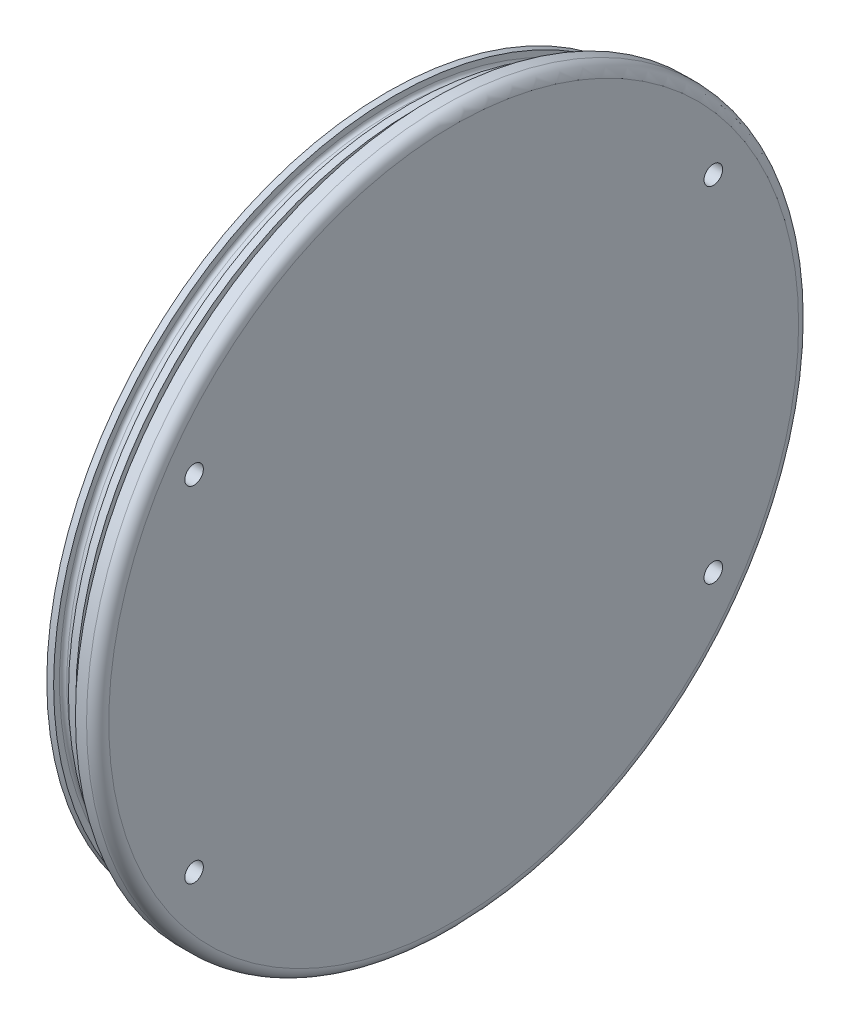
ISO-10303-21;
HEADER;
FILE_DESCRIPTION(('STEP AP214'),'2;1');
FILE_NAME('part.step','',(''),(''),'','','');
FILE_SCHEMA(('AUTOMOTIVE_DESIGN { 1 0 10303 214 1 1 1 1 }'));
ENDSEC;
DATA;
#1=APPLICATION_CONTEXT('core data for automotive mechanical design processes');
#2=APPLICATION_PROTOCOL_DEFINITION('international standard','automotive_design',2000,#1);
#3=PRODUCT_CONTEXT('',#1,'mechanical');
#4=PRODUCT('Part','Part','',(#3));
#5=PRODUCT_RELATED_PRODUCT_CATEGORY('part','',(#4));
#6=PRODUCT_DEFINITION_FORMATION('','',#4);
#7=PRODUCT_DEFINITION_CONTEXT('part definition',#1,'design');
#8=PRODUCT_DEFINITION('design','',#6,#7);
#9=PRODUCT_DEFINITION_SHAPE('','',#8);
#10=(LENGTH_UNIT() NAMED_UNIT(*) SI_UNIT(.MILLI.,.METRE.));
#11=(NAMED_UNIT(*) PLANE_ANGLE_UNIT() SI_UNIT($,.RADIAN.));
#12=(NAMED_UNIT(*) SI_UNIT($,.STERADIAN.) SOLID_ANGLE_UNIT());
#13=UNCERTAINTY_MEASURE_WITH_UNIT(LENGTH_MEASURE(1.E-05),#10,'distance_accuracy_value','');
#14=(GEOMETRIC_REPRESENTATION_CONTEXT(3) GLOBAL_UNCERTAINTY_ASSIGNED_CONTEXT((#13)) GLOBAL_UNIT_ASSIGNED_CONTEXT((#10,
#11,#12)) REPRESENTATION_CONTEXT('',''));
#15=CARTESIAN_POINT('',(0.,0.,0.));
#16=DIRECTION('',(0.,0.,1.));
#17=DIRECTION('',(1.,0.,0.));
#18=AXIS2_PLACEMENT_3D('',#15,#16,#17);
#19=CARTESIAN_POINT('',(9.525,0.,0.));
#20=DIRECTION('',(1.,0.,0.));
#21=DIRECTION('',(0.,0.,-1.));
#22=AXIS2_PLACEMENT_3D('',#19,#20,#21);
#23=PLANE('',#22);
#24=CARTESIAN_POINT('',(9.525,0.,0.));
#25=DIRECTION('',(1.,0.,0.));
#26=DIRECTION('',(0.,0.,-1.));
#27=AXIS2_PLACEMENT_3D('',#24,#25,#26);
#28=CIRCLE('',#27,147.6375);
#29=CARTESIAN_POINT('',(9.525,0.,-147.6375));
#30=VERTEX_POINT('',#29);
#31=EDGE_CURVE('E74',#30,#30,#28,.T.);
#32=ORIENTED_EDGE('',*,*,#31,.T.);
#33=EDGE_LOOP('',(#32));
#34=FACE_BOUND('',#33,.T.);
#35=CARTESIAN_POINT('',(9.525,-73.7119859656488,-111.125));
#36=DIRECTION('',(1.,0.,0.));
#37=DIRECTION('',(0.,0.,-1.));
#38=AXIS2_PLACEMENT_3D('',#35,#36,#37);
#39=CIRCLE('',#38,3.96874999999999);
#40=CARTESIAN_POINT('',(9.525,-73.7119859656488,-115.09375));
#41=VERTEX_POINT('',#40);
#42=EDGE_CURVE('E119',#41,#41,#39,.T.);
#43=ORIENTED_EDGE('',*,*,#42,.F.);
#44=EDGE_LOOP('',(#43));
#45=FACE_BOUND('',#44,.T.);
#46=CARTESIAN_POINT('',(9.525,-73.7119859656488,111.125));
#47=DIRECTION('',(1.,0.,0.));
#48=DIRECTION('',(0.,0.,-1.));
#49=AXIS2_PLACEMENT_3D('',#46,#47,#48);
#50=CIRCLE('',#49,3.96874999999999);
#51=CARTESIAN_POINT('',(9.525,-73.7119859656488,107.15625));
#52=VERTEX_POINT('',#51);
#53=EDGE_CURVE('E113',#52,#52,#50,.T.);
#54=ORIENTED_EDGE('',*,*,#53,.F.);
#55=EDGE_LOOP('',(#54));
#56=FACE_BOUND('',#55,.T.);
#57=CARTESIAN_POINT('',(9.525,73.7119859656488,111.125));
#58=DIRECTION('',(1.,0.,0.));
#59=DIRECTION('',(0.,0.,-1.));
#60=AXIS2_PLACEMENT_3D('',#57,#58,#59);
#61=CIRCLE('',#60,3.96874999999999);
#62=CARTESIAN_POINT('',(9.525,73.7119859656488,107.15625));
#63=VERTEX_POINT('',#62);
#64=EDGE_CURVE('E107',#63,#63,#61,.T.);
#65=ORIENTED_EDGE('',*,*,#64,.F.);
#66=EDGE_LOOP('',(#65));
#67=FACE_BOUND('',#66,.T.);
#68=CARTESIAN_POINT('',(9.525,73.7119859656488,-111.125));
#69=DIRECTION('',(1.,0.,0.));
#70=DIRECTION('',(0.,0.,-1.));
#71=AXIS2_PLACEMENT_3D('',#68,#69,#70);
#72=CIRCLE('',#71,3.96874999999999);
#73=CARTESIAN_POINT('',(9.525,73.7119859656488,-115.09375));
#74=VERTEX_POINT('',#73);
#75=EDGE_CURVE('E101',#74,#74,#72,.T.);
#76=ORIENTED_EDGE('',*,*,#75,.F.);
#77=EDGE_LOOP('',(#76));
#78=FACE_BOUND('',#77,.T.);
#79=ADVANCED_FACE('F39',(#34,#45,#56,#67,#78),#23,.T.);
#80=CARTESIAN_POINT('',(0.,0.,0.));
#81=DIRECTION('',(1.,0.,0.));
#82=DIRECTION('',(0.,0.,-1.));
#83=AXIS2_PLACEMENT_3D('',#80,#81,#82);
#84=CYLINDRICAL_SURFACE('',#83,152.4);
#85=CARTESIAN_POINT('',(4.7625,0.,0.));
#86=DIRECTION('',(1.,0.,0.));
#87=DIRECTION('',(0.,0.,-1.));
#88=AXIS2_PLACEMENT_3D('',#85,#86,#87);
#89=CIRCLE('',#88,152.4);
#90=CARTESIAN_POINT('',(4.7625,0.,-152.4));
#91=VERTEX_POINT('',#90);
#92=EDGE_CURVE('E71',#91,#91,#89,.F.);
#93=ORIENTED_EDGE('',*,*,#92,.T.);
#94=EDGE_LOOP('',(#93));
#95=FACE_BOUND('',#94,.T.);
#96=CARTESIAN_POINT('',(0.,0.,0.));
#97=DIRECTION('',(1.,0.,0.));
#98=DIRECTION('',(0.,0.,-1.));
#99=AXIS2_PLACEMENT_3D('',#96,#97,#98);
#100=CIRCLE('',#99,152.4);
#101=CARTESIAN_POINT('',(0.,0.,-152.4));
#102=VERTEX_POINT('',#101);
#103=EDGE_CURVE('E77',#102,#102,#100,.T.);
#104=ORIENTED_EDGE('',*,*,#103,.T.);
#105=EDGE_LOOP('',(#104));
#106=FACE_BOUND('',#105,.T.);
#107=ADVANCED_FACE('F127',(#95,#106),#84,.T.);
#108=CARTESIAN_POINT('',(0.,145.6055,0.));
#109=DIRECTION('',(-1.,0.,0.));
#110=DIRECTION('',(0.,0.,1.));
#111=AXIS2_PLACEMENT_3D('',#108,#109,#110);
#112=PLANE('',#111);
#113=CARTESIAN_POINT('',(0.,0.,0.));
#114=DIRECTION('',(1.,0.,0.));
#115=DIRECTION('',(0.,0.,-1.));
#116=AXIS2_PLACEMENT_3D('',#113,#114,#115);
#117=CIRCLE('',#116,145.6055);
#118=CARTESIAN_POINT('',(0.,0.,-145.6055));
#119=VERTEX_POINT('',#118);
#120=EDGE_CURVE('E80',#119,#119,#117,.T.);
#121=ORIENTED_EDGE('',*,*,#120,.T.);
#122=EDGE_LOOP('',(#121));
#123=FACE_BOUND('',#122,.T.);
#124=ORIENTED_EDGE('',*,*,#103,.F.);
#125=EDGE_LOOP('',(#124));
#126=FACE_BOUND('',#125,.T.);
#127=ADVANCED_FACE('F191',(#123,#126),#112,.T.);
#128=CARTESIAN_POINT('',(0.,0.,0.));
#129=DIRECTION('',(1.,0.,0.));
#130=DIRECTION('',(0.,0.,-1.));
#131=AXIS2_PLACEMENT_3D('',#128,#129,#130);
#132=CYLINDRICAL_SURFACE('',#131,145.6055);
#133=CARTESIAN_POINT('',(-0.254,0.,0.));
#134=DIRECTION('',(1.,0.,0.));
#135=DIRECTION('',(0.,0.,-1.));
#136=AXIS2_PLACEMENT_3D('',#133,#134,#135);
#137=CIRCLE('',#136,145.6055);
#138=CARTESIAN_POINT('',(-0.254,0.,-145.6055));
#139=VERTEX_POINT('',#138);
#140=EDGE_CURVE('E83',#139,#139,#137,.T.);
#141=ORIENTED_EDGE('',*,*,#140,.T.);
#142=EDGE_LOOP('',(#141));
#143=FACE_BOUND('',#142,.T.);
#144=ORIENTED_EDGE('',*,*,#120,.F.);
#145=EDGE_LOOP('',(#144));
#146=FACE_BOUND('',#145,.T.);
#147=ADVANCED_FACE('F188',(#143,#146),#132,.T.);
#148=CARTESIAN_POINT('',(-0.254,145.6055,0.));
#149=DIRECTION('',(-1.,0.,0.));
#150=DIRECTION('',(0.,0.,1.));
#151=AXIS2_PLACEMENT_3D('',#148,#149,#150);
#152=PLANE('',#151);
#153=CARTESIAN_POINT('',(-0.254,0.,0.));
#154=DIRECTION('',(-1.,0.,0.));
#155=DIRECTION('',(0.,0.,1.));
#156=AXIS2_PLACEMENT_3D('',#153,#154,#155);
#157=CIRCLE('',#156,143.0782);
#158=CARTESIAN_POINT('',(-0.254,0.,143.0782));
#159=VERTEX_POINT('',#158);
#160=EDGE_CURVE('E10',#159,#159,#157,.F.);
#161=ORIENTED_EDGE('',*,*,#160,.T.);
#162=EDGE_LOOP('',(#161));
#163=FACE_BOUND('',#162,.T.);
#164=ORIENTED_EDGE('',*,*,#140,.F.);
#165=EDGE_LOOP('',(#164));
#166=FACE_BOUND('',#165,.T.);
#167=ADVANCED_FACE('F184',(#163,#166),#152,.T.);
#168=CARTESIAN_POINT('',(0.,0.,0.));
#169=DIRECTION('',(1.,0.,0.));
#170=DIRECTION('',(0.,0.,-1.));
#171=AXIS2_PLACEMENT_3D('',#168,#169,#170);
#172=CYLINDRICAL_SURFACE('',#171,141.4907);
#173=CARTESIAN_POINT('',(-5.0165,0.,0.));
#174=DIRECTION('',(1.,0.,0.));
#175=DIRECTION('',(0.,0.,-1.));
#176=AXIS2_PLACEMENT_3D('',#173,#174,#175);
#177=CIRCLE('',#176,141.4907);
#178=CARTESIAN_POINT('',(-5.0165,0.,-141.4907));
#179=VERTEX_POINT('',#178);
#180=EDGE_CURVE('E50',#179,#179,#177,.T.);
#181=ORIENTED_EDGE('',*,*,#180,.T.);
#182=EDGE_LOOP('',(#181));
#183=FACE_BOUND('',#182,.T.);
#184=CARTESIAN_POINT('',(-1.8415,0.,0.));
#185=DIRECTION('',(-1.,0.,0.));
#186=DIRECTION('',(0.,0.,1.));
#187=AXIS2_PLACEMENT_3D('',#184,#185,#186);
#188=CIRCLE('',#187,141.4907);
#189=CARTESIAN_POINT('',(-1.8415,0.,141.4907));
#190=VERTEX_POINT('',#189);
#191=EDGE_CURVE('E54',#190,#190,#188,.T.);
#192=ORIENTED_EDGE('',*,*,#191,.T.);
#193=EDGE_LOOP('',(#192));
#194=FACE_BOUND('',#193,.T.);
#195=ADVANCED_FACE('F181',(#183,#194),#172,.T.);
#196=CARTESIAN_POINT('',(-6.604,141.4907,0.));
#197=DIRECTION('',(1.,0.,0.));
#198=DIRECTION('',(0.,0.,-1.));
#199=AXIS2_PLACEMENT_3D('',#196,#197,#198);
#200=PLANE('',#199);
#201=CARTESIAN_POINT('',(-6.604,0.,0.));
#202=DIRECTION('',(1.,0.,0.));
#203=DIRECTION('',(0.,0.,-1.));
#204=AXIS2_PLACEMENT_3D('',#201,#202,#203);
#205=CIRCLE('',#204,143.0782);
#206=CARTESIAN_POINT('',(-6.604,0.,-143.0782));
#207=VERTEX_POINT('',#206);
#208=EDGE_CURVE('E46',#207,#207,#205,.F.);
#209=ORIENTED_EDGE('',*,*,#208,.T.);
#210=EDGE_LOOP('',(#209));
#211=FACE_BOUND('',#210,.T.);
#212=CARTESIAN_POINT('',(-6.604,0.,0.));
#213=DIRECTION('',(1.,0.,0.));
#214=DIRECTION('',(0.,0.,-1.));
#215=AXIS2_PLACEMENT_3D('',#212,#213,#214);
#216=CIRCLE('',#215,145.6055);
#217=CARTESIAN_POINT('',(-6.604,0.,-145.6055));
#218=VERTEX_POINT('',#217);
#219=EDGE_CURVE('E86',#218,#218,#216,.T.);
#220=ORIENTED_EDGE('',*,*,#219,.T.);
#221=EDGE_LOOP('',(#220));
#222=FACE_BOUND('',#221,.T.);
#223=ADVANCED_FACE('F177',(#211,#222),#200,.T.);
#224=CARTESIAN_POINT('',(0.,0.,0.));
#225=DIRECTION('',(1.,0.,0.));
#226=DIRECTION('',(0.,0.,-1.));
#227=AXIS2_PLACEMENT_3D('',#224,#225,#226);
#228=CYLINDRICAL_SURFACE('',#227,145.6055);
#229=CARTESIAN_POINT('',(-9.779,0.,0.));
#230=DIRECTION('',(1.,0.,0.));
#231=DIRECTION('',(0.,0.,-1.));
#232=AXIS2_PLACEMENT_3D('',#229,#230,#231);
#233=CIRCLE('',#232,145.6055);
#234=CARTESIAN_POINT('',(-9.779,0.,-145.6055));
#235=VERTEX_POINT('',#234);
#236=EDGE_CURVE('E89',#235,#235,#233,.T.);
#237=ORIENTED_EDGE('',*,*,#236,.T.);
#238=EDGE_LOOP('',(#237));
#239=FACE_BOUND('',#238,.T.);
#240=ORIENTED_EDGE('',*,*,#219,.F.);
#241=EDGE_LOOP('',(#240));
#242=FACE_BOUND('',#241,.T.);
#243=ADVANCED_FACE('F173',(#239,#242),#228,.T.);
#244=CARTESIAN_POINT('',(-9.779,145.6055,0.));
#245=DIRECTION('',(-1.,0.,0.));
#246=DIRECTION('',(0.,0.,1.));
#247=AXIS2_PLACEMENT_3D('',#244,#245,#246);
#248=PLANE('',#247);
#249=CARTESIAN_POINT('',(-9.779,0.,0.));
#250=DIRECTION('',(-1.,0.,0.));
#251=DIRECTION('',(0.,0.,1.));
#252=AXIS2_PLACEMENT_3D('',#249,#250,#251);
#253=CIRCLE('',#252,143.0782);
#254=CARTESIAN_POINT('',(-9.779,0.,143.0782));
#255=VERTEX_POINT('',#254);
#256=EDGE_CURVE('E59',#255,#255,#253,.F.);
#257=ORIENTED_EDGE('',*,*,#256,.T.);
#258=EDGE_LOOP('',(#257));
#259=FACE_BOUND('',#258,.T.);
#260=ORIENTED_EDGE('',*,*,#236,.F.);
#261=EDGE_LOOP('',(#260));
#262=FACE_BOUND('',#261,.T.);
#263=ADVANCED_FACE('F169',(#259,#262),#248,.T.);
#264=CARTESIAN_POINT('',(0.,0.,0.));
#265=DIRECTION('',(1.,0.,0.));
#266=DIRECTION('',(0.,0.,-1.));
#267=AXIS2_PLACEMENT_3D('',#264,#265,#266);
#268=CYLINDRICAL_SURFACE('',#267,141.4907);
#269=CARTESIAN_POINT('',(-14.5415,0.,0.));
#270=DIRECTION('',(1.,0.,0.));
#271=DIRECTION('',(0.,0.,-1.));
#272=AXIS2_PLACEMENT_3D('',#269,#270,#271);
#273=CIRCLE('',#272,141.4907);
#274=CARTESIAN_POINT('',(-14.5415,0.,-141.4907));
#275=VERTEX_POINT('',#274);
#276=EDGE_CURVE('E65',#275,#275,#273,.T.);
#277=ORIENTED_EDGE('',*,*,#276,.T.);
#278=EDGE_LOOP('',(#277));
#279=FACE_BOUND('',#278,.T.);
#280=CARTESIAN_POINT('',(-11.3665,0.,0.));
#281=DIRECTION('',(-1.,0.,0.));
#282=DIRECTION('',(0.,0.,1.));
#283=AXIS2_PLACEMENT_3D('',#280,#281,#282);
#284=CIRCLE('',#283,141.4907);
#285=CARTESIAN_POINT('',(-11.3665,0.,141.4907));
#286=VERTEX_POINT('',#285);
#287=EDGE_CURVE('E68',#286,#286,#284,.T.);
#288=ORIENTED_EDGE('',*,*,#287,.T.);
#289=EDGE_LOOP('',(#288));
#290=FACE_BOUND('',#289,.T.);
#291=ADVANCED_FACE('F165',(#279,#290),#268,.T.);
#292=CARTESIAN_POINT('',(-16.129,141.4907,0.));
#293=DIRECTION('',(1.,0.,0.));
#294=DIRECTION('',(0.,0.,-1.));
#295=AXIS2_PLACEMENT_3D('',#292,#293,#294);
#296=PLANE('',#295);
#297=CARTESIAN_POINT('',(-16.129,0.,0.));
#298=DIRECTION('',(1.,0.,0.));
#299=DIRECTION('',(0.,0.,-1.));
#300=AXIS2_PLACEMENT_3D('',#297,#298,#299);
#301=CIRCLE('',#300,143.0782);
#302=CARTESIAN_POINT('',(-16.129,0.,-143.0782));
#303=VERTEX_POINT('',#302);
#304=EDGE_CURVE('E62',#303,#303,#301,.F.);
#305=ORIENTED_EDGE('',*,*,#304,.T.);
#306=EDGE_LOOP('',(#305));
#307=FACE_BOUND('',#306,.T.);
#308=CARTESIAN_POINT('',(-16.129,0.,0.));
#309=DIRECTION('',(1.,0.,0.));
#310=DIRECTION('',(0.,0.,-1.));
#311=AXIS2_PLACEMENT_3D('',#308,#309,#310);
#312=CIRCLE('',#311,145.6055);
#313=CARTESIAN_POINT('',(-16.129,0.,-145.6055));
#314=VERTEX_POINT('',#313);
#315=EDGE_CURVE('E92',#314,#314,#312,.T.);
#316=ORIENTED_EDGE('',*,*,#315,.T.);
#317=EDGE_LOOP('',(#316));
#318=FACE_BOUND('',#317,.T.);
#319=ADVANCED_FACE('F161',(#307,#318),#296,.T.);
#320=CARTESIAN_POINT('',(0.,0.,0.));
#321=DIRECTION('',(1.,0.,0.));
#322=DIRECTION('',(0.,0.,-1.));
#323=AXIS2_PLACEMENT_3D('',#320,#321,#322);
#324=CYLINDRICAL_SURFACE('',#323,145.6055);
#325=CARTESIAN_POINT('',(-19.05,0.,0.));
#326=DIRECTION('',(1.,0.,0.));
#327=DIRECTION('',(0.,0.,-1.));
#328=AXIS2_PLACEMENT_3D('',#325,#326,#327);
#329=CIRCLE('',#328,145.6055);
#330=CARTESIAN_POINT('',(-19.05,0.,-145.6055));
#331=VERTEX_POINT('',#330);
#332=EDGE_CURVE('E95',#331,#331,#329,.T.);
#333=ORIENTED_EDGE('',*,*,#332,.T.);
#334=EDGE_LOOP('',(#333));
#335=FACE_BOUND('',#334,.T.);
#336=ORIENTED_EDGE('',*,*,#315,.F.);
#337=EDGE_LOOP('',(#336));
#338=FACE_BOUND('',#337,.T.);
#339=ADVANCED_FACE('F157',(#335,#338),#324,.T.);
#340=CARTESIAN_POINT('',(-19.05,145.6055,0.));
#341=DIRECTION('',(-1.,0.,0.));
#342=DIRECTION('',(0.,0.,1.));
#343=AXIS2_PLACEMENT_3D('',#340,#341,#342);
#344=PLANE('',#343);
#345=ORIENTED_EDGE('',*,*,#332,.F.);
#346=EDGE_LOOP('',(#345));
#347=FACE_BOUND('',#346,.T.);
#348=ADVANCED_FACE('F149',(#347),#344,.T.);
#349=CARTESIAN_POINT('',(-3.175,73.7119859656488,-111.125));
#350=DIRECTION('',(-1.,0.,0.));
#351=DIRECTION('',(0.,0.,1.));
#352=AXIS2_PLACEMENT_3D('',#349,#350,#351);
#353=PLANE('',#352);
#354=CARTESIAN_POINT('',(-3.175,73.7119859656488,-111.125));
#355=DIRECTION('',(1.,0.,0.));
#356=DIRECTION('',(0.,0.,-1.));
#357=AXIS2_PLACEMENT_3D('',#354,#355,#356);
#358=CIRCLE('',#357,3.96874999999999);
#359=CARTESIAN_POINT('',(-3.175,73.7119859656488,-115.09375));
#360=VERTEX_POINT('',#359);
#361=EDGE_CURVE('E98',#360,#360,#358,.T.);
#362=ORIENTED_EDGE('',*,*,#361,.T.);
#363=EDGE_LOOP('',(#362));
#364=FACE_BOUND('',#363,.T.);
#365=ADVANCED_FACE('F139',(#364),#353,.F.);
#366=CARTESIAN_POINT('',(9.525,73.7119859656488,-111.125));
#367=DIRECTION('',(1.,0.,0.));
#368=DIRECTION('',(0.,0.,-1.));
#369=AXIS2_PLACEMENT_3D('',#366,#367,#368);
#370=CYLINDRICAL_SURFACE('',#369,3.96874999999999);
#371=ORIENTED_EDGE('',*,*,#361,.F.);
#372=EDGE_LOOP('',(#371));
#373=FACE_BOUND('',#372,.T.);
#374=ORIENTED_EDGE('',*,*,#75,.T.);
#375=EDGE_LOOP('',(#374));
#376=FACE_BOUND('',#375,.T.);
#377=ADVANCED_FACE('F136',(#373,#376),#370,.F.);
#378=CARTESIAN_POINT('',(-3.175,73.7119859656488,111.125));
#379=DIRECTION('',(-1.,0.,0.));
#380=DIRECTION('',(0.,0.,1.));
#381=AXIS2_PLACEMENT_3D('',#378,#379,#380);
#382=PLANE('',#381);
#383=CARTESIAN_POINT('',(-3.175,73.7119859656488,111.125));
#384=DIRECTION('',(1.,0.,0.));
#385=DIRECTION('',(0.,0.,-1.));
#386=AXIS2_PLACEMENT_3D('',#383,#384,#385);
#387=CIRCLE('',#386,3.96874999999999);
#388=CARTESIAN_POINT('',(-3.175,73.7119859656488,107.15625));
#389=VERTEX_POINT('',#388);
#390=EDGE_CURVE('E104',#389,#389,#387,.T.);
#391=ORIENTED_EDGE('',*,*,#390,.T.);
#392=EDGE_LOOP('',(#391));
#393=FACE_BOUND('',#392,.T.);
#394=ADVANCED_FACE('F138',(#393),#382,.F.);
#395=CARTESIAN_POINT('',(9.525,73.7119859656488,111.125));
#396=DIRECTION('',(1.,0.,0.));
#397=DIRECTION('',(0.,0.,-1.));
#398=AXIS2_PLACEMENT_3D('',#395,#396,#397);
#399=CYLINDRICAL_SURFACE('',#398,3.96874999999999);
#400=ORIENTED_EDGE('',*,*,#390,.F.);
#401=EDGE_LOOP('',(#400));
#402=FACE_BOUND('',#401,.T.);
#403=ORIENTED_EDGE('',*,*,#64,.T.);
#404=EDGE_LOOP('',(#403));
#405=FACE_BOUND('',#404,.T.);
#406=ADVANCED_FACE('F146',(#402,#405),#399,.F.);
#407=CARTESIAN_POINT('',(-3.175,-73.7119859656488,111.125));
#408=DIRECTION('',(-1.,0.,0.));
#409=DIRECTION('',(0.,0.,1.));
#410=AXIS2_PLACEMENT_3D('',#407,#408,#409);
#411=PLANE('',#410);
#412=CARTESIAN_POINT('',(-3.175,-73.7119859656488,111.125));
#413=DIRECTION('',(1.,0.,0.));
#414=DIRECTION('',(0.,0.,-1.));
#415=AXIS2_PLACEMENT_3D('',#412,#413,#414);
#416=CIRCLE('',#415,3.96874999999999);
#417=CARTESIAN_POINT('',(-3.175,-73.7119859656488,107.15625));
#418=VERTEX_POINT('',#417);
#419=EDGE_CURVE('E110',#418,#418,#416,.T.);
#420=ORIENTED_EDGE('',*,*,#419,.T.);
#421=EDGE_LOOP('',(#420));
#422=FACE_BOUND('',#421,.T.);
#423=ADVANCED_FACE('F329',(#422),#411,.F.);
#424=CARTESIAN_POINT('',(9.525,-73.7119859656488,111.125));
#425=DIRECTION('',(1.,0.,0.));
#426=DIRECTION('',(0.,0.,-1.));
#427=AXIS2_PLACEMENT_3D('',#424,#425,#426);
#428=CYLINDRICAL_SURFACE('',#427,3.96874999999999);
#429=ORIENTED_EDGE('',*,*,#419,.F.);
#430=EDGE_LOOP('',(#429));
#431=FACE_BOUND('',#430,.T.);
#432=ORIENTED_EDGE('',*,*,#53,.T.);
#433=EDGE_LOOP('',(#432));
#434=FACE_BOUND('',#433,.T.);
#435=ADVANCED_FACE('F318',(#431,#434),#428,.F.);
#436=CARTESIAN_POINT('',(-3.175,-73.7119859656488,-111.125));
#437=DIRECTION('',(-1.,0.,0.));
#438=DIRECTION('',(0.,0.,1.));
#439=AXIS2_PLACEMENT_3D('',#436,#437,#438);
#440=PLANE('',#439);
#441=CARTESIAN_POINT('',(-3.175,-73.7119859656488,-111.125));
#442=DIRECTION('',(1.,0.,0.));
#443=DIRECTION('',(0.,0.,-1.));
#444=AXIS2_PLACEMENT_3D('',#441,#442,#443);
#445=CIRCLE('',#444,3.96874999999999);
#446=CARTESIAN_POINT('',(-3.175,-73.7119859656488,-115.09375));
#447=VERTEX_POINT('',#446);
#448=EDGE_CURVE('E116',#447,#447,#445,.T.);
#449=ORIENTED_EDGE('',*,*,#448,.T.);
#450=EDGE_LOOP('',(#449));
#451=FACE_BOUND('',#450,.T.);
#452=ADVANCED_FACE('F308',(#451),#440,.F.);
#453=CARTESIAN_POINT('',(9.525,-73.7119859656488,-111.125));
#454=DIRECTION('',(1.,0.,0.));
#455=DIRECTION('',(0.,0.,-1.));
#456=AXIS2_PLACEMENT_3D('',#453,#454,#455);
#457=CYLINDRICAL_SURFACE('',#456,3.96874999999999);
#458=ORIENTED_EDGE('',*,*,#448,.F.);
#459=EDGE_LOOP('',(#458));
#460=FACE_BOUND('',#459,.T.);
#461=ORIENTED_EDGE('',*,*,#42,.T.);
#462=EDGE_LOOP('',(#461));
#463=FACE_BOUND('',#462,.T.);
#464=ADVANCED_FACE('F123',(#460,#463),#457,.F.);
#465=CARTESIAN_POINT('',(4.7625,0.,0.));
#466=DIRECTION('',(1.,0.,0.));
#467=DIRECTION('',(0.,0.,-1.));
#468=AXIS2_PLACEMENT_3D('',#465,#466,#467);
#469=TOROIDAL_SURFACE('',#468,147.6375,4.7625);
#470=ORIENTED_EDGE('',*,*,#92,.F.);
#471=EDGE_LOOP('',(#470));
#472=FACE_BOUND('',#471,.T.);
#473=ORIENTED_EDGE('',*,*,#31,.F.);
#474=EDGE_LOOP('',(#473));
#475=FACE_BOUND('',#474,.T.);
#476=ADVANCED_FACE('F199',(#472,#475),#469,.T.);
#477=CARTESIAN_POINT('',(-14.5415,0.,0.));
#478=DIRECTION('',(1.,0.,0.));
#479=DIRECTION('',(0.,0.,-1.));
#480=AXIS2_PLACEMENT_3D('',#477,#478,#479);
#481=TOROIDAL_SURFACE('',#480,143.0782,1.5875);
#482=ORIENTED_EDGE('',*,*,#304,.F.);
#483=EDGE_LOOP('',(#482));
#484=FACE_BOUND('',#483,.T.);
#485=ORIENTED_EDGE('',*,*,#276,.F.);
#486=EDGE_LOOP('',(#485));
#487=FACE_BOUND('',#486,.T.);
#488=ADVANCED_FACE('F202',(#484,#487),#481,.F.);
#489=CARTESIAN_POINT('',(-11.3665,0.,0.));
#490=DIRECTION('',(-1.,0.,0.));
#491=DIRECTION('',(0.,0.,1.));
#492=AXIS2_PLACEMENT_3D('',#489,#490,#491);
#493=TOROIDAL_SURFACE('',#492,143.0782,1.5875);
#494=ORIENTED_EDGE('',*,*,#287,.F.);
#495=EDGE_LOOP('',(#494));
#496=FACE_BOUND('',#495,.T.);
#497=ORIENTED_EDGE('',*,*,#256,.F.);
#498=EDGE_LOOP('',(#497));
#499=FACE_BOUND('',#498,.T.);
#500=ADVANCED_FACE('F206',(#496,#499),#493,.F.);
#501=CARTESIAN_POINT('',(-5.0165,0.,0.));
#502=DIRECTION('',(1.,0.,0.));
#503=DIRECTION('',(0.,0.,-1.));
#504=AXIS2_PLACEMENT_3D('',#501,#502,#503);
#505=TOROIDAL_SURFACE('',#504,143.0782,1.5875);
#506=ORIENTED_EDGE('',*,*,#208,.F.);
#507=EDGE_LOOP('',(#506));
#508=FACE_BOUND('',#507,.T.);
#509=ORIENTED_EDGE('',*,*,#180,.F.);
#510=EDGE_LOOP('',(#509));
#511=FACE_BOUND('',#510,.T.);
#512=ADVANCED_FACE('F209',(#508,#511),#505,.F.);
#513=CARTESIAN_POINT('',(-1.8415,0.,0.));
#514=DIRECTION('',(-1.,0.,0.));
#515=DIRECTION('',(0.,0.,1.));
#516=AXIS2_PLACEMENT_3D('',#513,#514,#515);
#517=TOROIDAL_SURFACE('',#516,143.0782,1.5875);
#518=ORIENTED_EDGE('',*,*,#191,.F.);
#519=EDGE_LOOP('',(#518));
#520=FACE_BOUND('',#519,.T.);
#521=ORIENTED_EDGE('',*,*,#160,.F.);
#522=EDGE_LOOP('',(#521));
#523=FACE_BOUND('',#522,.T.);
#524=ADVANCED_FACE('F41',(#520,#523),#517,.F.);
#525=CLOSED_SHELL('',(#79,#107,#127,#147,#167,#195,#223,#243,#263,#291,#319,#339,#348,#365,#377,
#394,#406,#423,#435,#452,#464,#476,#488,#500,#512,#524));
#526=MANIFOLD_SOLID_BREP('B2',#525);
#527=ADVANCED_BREP_SHAPE_REPRESENTATION('',(#18,#526),#14);
#528=SHAPE_DEFINITION_REPRESENTATION(#9,#527);
ENDSEC;
END-ISO-10303-21;
